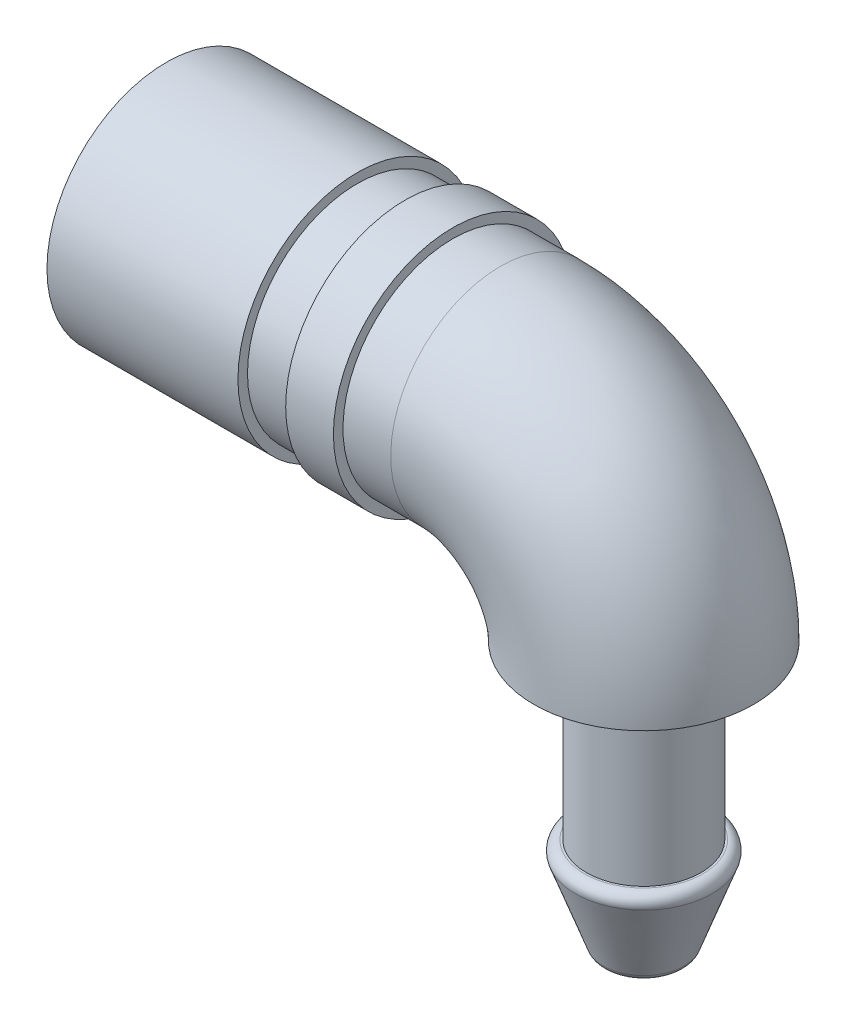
from build123d import *

# Parameters (mm, degrees)
CROQUIS3_R  = 11.5
REDONDEO1_R = 1


with BuildPart() as part:
    # Croquis1 → Revoluci_n1 (revolve)
    with BuildSketch(Plane.XY, mode=Mode.PRIVATE) as revoluci_n1_sk:
        Polygon((0, 0), (0, 12.5), (20, 12.5), (20, 11.5), (25, 11.5), (25, 12.5), (30, 12.5), (30, 0), align=None)
    revolve(revoluci_n1_sk.sketch.rotate(Axis((0, 0, 0), (1, 0, 0)), 90), axis=Axis((0, 0, 0), (1, 0, 0)))

    # Barrer1: sweep along a path in Croquis2
    with BuildLine(Plane.XY.offset(11.5)) as barrer1_path:
        Line((30, 0), (35, 0))
        ThreePointArc((35, 0), (45.606601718, -4.393398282), (50, -15))
        Line((50, -15), (50, -15.002946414))
    # Croquis3 → Barrer1 (sweep)
    with BuildSketch(Plane(origin=(30, 0, 0), x_dir=(0, 0, -1), z_dir=(1, 0, 0))):
        Circle(CROQUIS3_R)
    sweep(path=barrer1_path.line)

    # Croquis4 → Revoluci_n2 (revolve)
    with BuildSketch(Plane.XY, mode=Mode.PRIVATE) as revoluci_n2_sk:
        Polygon((50, -15.002946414), (56, -15.002946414), (56, -33.002946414), (57.639702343, -33.002946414), (54, -43.002946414), (50, -43.002946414), align=None)
    revolve(revoluci_n2_sk.sketch.rotate(Axis((50, -15.002946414, 0), (0, -1, 0)), 90), axis=Axis((50, -15.002946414, 0), (0, -1, 0)))

    # Redondeo1
    redondeo1_edges = [part.edges().sort_by_distance(p)[0] for p in [
        (50, -33.002946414, -7.639702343),
        (50, -43.002946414, -4),
    ]]
    fillet(redondeo1_edges, radius=REDONDEO1_R)


solid = part.part
